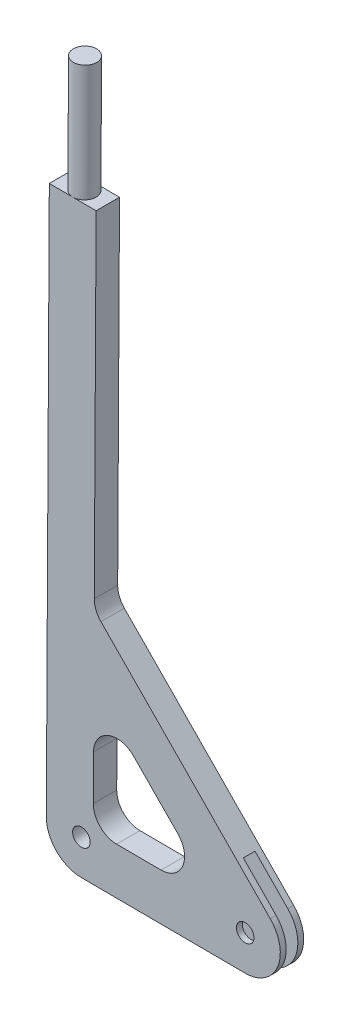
ISO-10303-21;
HEADER;
FILE_DESCRIPTION(('STEP AP214'),'2;1');
FILE_NAME('part.step','',(''),(''),'','','');
FILE_SCHEMA(('AUTOMOTIVE_DESIGN { 1 0 10303 214 1 1 1 1 }'));
ENDSEC;
DATA;
#1=APPLICATION_CONTEXT('core data for automotive mechanical design processes');
#2=APPLICATION_PROTOCOL_DEFINITION('international standard','automotive_design',2000,#1);
#3=PRODUCT_CONTEXT('',#1,'mechanical');
#4=PRODUCT('Part','Part','',(#3));
#5=PRODUCT_RELATED_PRODUCT_CATEGORY('part','',(#4));
#6=PRODUCT_DEFINITION_FORMATION('','',#4);
#7=PRODUCT_DEFINITION_CONTEXT('part definition',#1,'design');
#8=PRODUCT_DEFINITION('design','',#6,#7);
#9=PRODUCT_DEFINITION_SHAPE('','',#8);
#10=(LENGTH_UNIT() NAMED_UNIT(*) SI_UNIT(.MILLI.,.METRE.));
#11=(NAMED_UNIT(*) PLANE_ANGLE_UNIT() SI_UNIT($,.RADIAN.));
#12=(NAMED_UNIT(*) SI_UNIT($,.STERADIAN.) SOLID_ANGLE_UNIT());
#13=UNCERTAINTY_MEASURE_WITH_UNIT(LENGTH_MEASURE(1.E-05),#10,'distance_accuracy_value','');
#14=(GEOMETRIC_REPRESENTATION_CONTEXT(3) GLOBAL_UNCERTAINTY_ASSIGNED_CONTEXT((#13)) GLOBAL_UNIT_ASSIGNED_CONTEXT((#10,
#11,#12)) REPRESENTATION_CONTEXT('',''));
#15=CARTESIAN_POINT('',(0.,0.,0.));
#16=DIRECTION('',(0.,0.,1.));
#17=DIRECTION('',(1.,0.,0.));
#18=AXIS2_PLACEMENT_3D('',#15,#16,#17);
#19=CARTESIAN_POINT('',(359.062031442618,352.13946195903,12.7));
#20=DIRECTION('',(0.713955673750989,0.700190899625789,0.));
#21=DIRECTION('',(-0.700190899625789,0.713955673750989,0.));
#22=AXIS2_PLACEMENT_3D('',#19,#20,#21);
#23=PLANE('',#22);
#24=DIRECTION('',(0.,0.,1.));
#25=VECTOR('',#24,1.);
#26=CARTESIAN_POINT('',(426.491751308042,283.384168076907,-6.35));
#27=LINE('',#26,#25);
#28=CARTESIAN_POINT('',(426.491751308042,283.384168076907,-6.35));
#29=VERTEX_POINT('',#28);
#30=CARTESIAN_POINT('',(426.491751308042,283.384168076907,6.35));
#31=VERTEX_POINT('',#30);
#32=EDGE_CURVE('E203',#29,#31,#27,.T.);
#33=ORIENTED_EDGE('',*,*,#32,.F.);
#34=DIRECTION('',(0.700190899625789,-0.713955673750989,0.));
#35=VECTOR('',#34,1.);
#36=CARTESIAN_POINT('',(359.062031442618,352.13946195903,-6.35));
#37=LINE('',#36,#35);
#38=CARTESIAN_POINT('',(462.061449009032,247.115219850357,-6.35));
#39=VERTEX_POINT('',#38);
#40=EDGE_CURVE('E184',#29,#39,#37,.T.);
#41=ORIENTED_EDGE('',*,*,#40,.T.);
#42=DIRECTION('',(0.,0.,-1.));
#43=VECTOR('',#42,1.);
#44=CARTESIAN_POINT('',(462.061449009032,247.115219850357,12.7));
#45=LINE('',#44,#43);
#46=CARTESIAN_POINT('',(462.061449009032,247.115219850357,-12.7));
#47=VERTEX_POINT('',#46);
#48=EDGE_CURVE('E330',#39,#47,#45,.T.);
#49=ORIENTED_EDGE('',*,*,#48,.T.);
#50=DIRECTION('',(0.700190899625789,-0.713955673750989,0.));
#51=VECTOR('',#50,1.);
#52=CARTESIAN_POINT('',(359.062031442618,352.13946195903,-12.7));
#53=LINE('',#52,#51);
#54=CARTESIAN_POINT('',(278.285606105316,434.503838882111,-12.7));
#55=VERTEX_POINT('',#54);
#56=EDGE_CURVE('E298',#55,#47,#53,.T.);
#57=ORIENTED_EDGE('',*,*,#56,.F.);
#58=DIRECTION('',(0.,0.,-1.));
#59=VECTOR('',#58,1.);
#60=CARTESIAN_POINT('',(278.285606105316,434.503838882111,12.7));
#61=LINE('',#60,#59);
#62=CARTESIAN_POINT('',(278.285606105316,434.503838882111,12.7));
#63=VERTEX_POINT('',#62);
#64=EDGE_CURVE('E344',#63,#55,#61,.T.);
#65=ORIENTED_EDGE('',*,*,#64,.F.);
#66=DIRECTION('',(0.700190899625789,-0.713955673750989,0.));
#67=VECTOR('',#66,1.);
#68=CARTESIAN_POINT('',(359.062031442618,352.13946195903,12.7));
#69=LINE('',#68,#67);
#70=CARTESIAN_POINT('',(462.061449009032,247.115219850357,12.7));
#71=VERTEX_POINT('',#70);
#72=EDGE_CURVE('E255',#63,#71,#69,.T.);
#73=ORIENTED_EDGE('',*,*,#72,.T.);
#74=CARTESIAN_POINT('',(462.061449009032,247.115219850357,6.35));
#75=VERTEX_POINT('',#74);
#76=EDGE_CURVE('E322',#71,#75,#45,.T.);
#77=ORIENTED_EDGE('',*,*,#76,.T.);
#78=DIRECTION('',(0.700190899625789,-0.713955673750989,0.));
#79=VECTOR('',#78,1.);
#80=CARTESIAN_POINT('',(359.062031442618,352.13946195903,6.35));
#81=LINE('',#80,#79);
#82=EDGE_CURVE('E57',#31,#75,#81,.T.);
#83=ORIENTED_EDGE('',*,*,#82,.F.);
#84=EDGE_LOOP('',(#33,#41,#49,#57,#65,#73,#77,#83));
#85=FACE_BOUND('',#84,.T.);
#86=ADVANCED_FACE('F41',(#85),#23,.T.);
#87=CARTESIAN_POINT('',(1.00782110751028,184.704645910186,12.7));
#88=DIRECTION('',(0.00545631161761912,0.999985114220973,0.));
#89=DIRECTION('',(-0.999985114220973,0.00545631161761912,0.));
#90=AXIS2_PLACEMENT_3D('',#87,#88,#89);
#91=PLANE('',#90);
#92=DIRECTION('',(0.999985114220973,-0.00545631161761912,0.));
#93=VECTOR('',#92,1.);
#94=CARTESIAN_POINT('',(1.00782110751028,184.704645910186,-6.35));
#95=LINE('',#94,#93);
#96=CARTESIAN_POINT('',(383.85336475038,182.615690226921,-6.35));
#97=VERTEX_POINT('',#96);
#98=CARTESIAN_POINT('',(434.651852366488,182.338513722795,-6.35));
#99=VERTEX_POINT('',#98);
#100=EDGE_CURVE('E194',#97,#99,#95,.T.);
#101=ORIENTED_EDGE('',*,*,#100,.F.);
#102=DIRECTION('',(0.,0.,1.));
#103=VECTOR('',#102,1.);
#104=CARTESIAN_POINT('',(383.85336475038,182.615690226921,-6.35));
#105=LINE('',#104,#103);
#106=CARTESIAN_POINT('',(383.85336475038,182.615690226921,6.35));
#107=VERTEX_POINT('',#106);
#108=EDGE_CURVE('E220',#97,#107,#105,.T.);
#109=ORIENTED_EDGE('',*,*,#108,.T.);
#110=DIRECTION('',(0.999985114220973,-0.00545631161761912,0.));
#111=VECTOR('',#110,1.);
#112=CARTESIAN_POINT('',(1.00782110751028,184.704645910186,6.35));
#113=LINE('',#112,#111);
#114=CARTESIAN_POINT('',(434.651852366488,182.338513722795,6.35));
#115=VERTEX_POINT('',#114);
#116=EDGE_CURVE('E212',#107,#115,#113,.T.);
#117=ORIENTED_EDGE('',*,*,#116,.T.);
#118=DIRECTION('',(0.,0.,-1.));
#119=VECTOR('',#118,1.);
#120=CARTESIAN_POINT('',(434.651852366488,182.338513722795,12.7));
#121=LINE('',#120,#119);
#122=CARTESIAN_POINT('',(434.651852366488,182.338513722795,12.7));
#123=VERTEX_POINT('',#122);
#124=EDGE_CURVE('E327',#123,#115,#121,.T.);
#125=ORIENTED_EDGE('',*,*,#124,.F.);
#126=DIRECTION('',(0.999985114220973,-0.00545631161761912,0.));
#127=VECTOR('',#126,1.);
#128=CARTESIAN_POINT('',(1.00782110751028,184.704645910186,12.7));
#129=LINE('',#128,#127);
#130=CARTESIAN_POINT('',(256.851852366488,183.308660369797,12.7));
#131=VERTEX_POINT('',#130);
#132=EDGE_CURVE('E275',#131,#123,#129,.T.);
#133=ORIENTED_EDGE('',*,*,#132,.F.);
#134=DIRECTION('',(0.,0.,-1.));
#135=VECTOR('',#134,1.);
#136=CARTESIAN_POINT('',(256.851852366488,183.308660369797,12.7));
#137=LINE('',#136,#135);
#138=CARTESIAN_POINT('',(256.851852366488,183.308660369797,-12.7));
#139=VERTEX_POINT('',#138);
#140=EDGE_CURVE('E332',#131,#139,#137,.T.);
#141=ORIENTED_EDGE('',*,*,#140,.T.);
#142=DIRECTION('',(0.999985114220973,-0.00545631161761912,0.));
#143=VECTOR('',#142,1.);
#144=CARTESIAN_POINT('',(1.00782110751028,184.704645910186,-12.7));
#145=LINE('',#144,#143);
#146=CARTESIAN_POINT('',(434.651852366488,182.338513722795,-12.7));
#147=VERTEX_POINT('',#146);
#148=EDGE_CURVE('E317',#139,#147,#145,.T.);
#149=ORIENTED_EDGE('',*,*,#148,.T.);
#150=EDGE_CURVE('E326',#99,#147,#121,.T.);
#151=ORIENTED_EDGE('',*,*,#150,.F.);
#152=EDGE_LOOP('',(#101,#109,#117,#125,#133,#141,#149,#151));
#153=FACE_BOUND('',#152,.T.);
#154=ADVANCED_FACE('F384',(#153),#91,.F.);
#155=CARTESIAN_POINT('',(434.859737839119,220.437946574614,12.7));
#156=DIRECTION('',(0.,0.,-1.));
#157=DIRECTION('',(-1.,0.,0.));
#158=AXIS2_PLACEMENT_3D('',#155,#156,#157);
#159=CYLINDRICAL_SURFACE('',#158,9.52500000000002);
#160=CARTESIAN_POINT('',(434.859737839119,220.437946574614,-12.7));
#161=DIRECTION('',(0.,0.,1.));
#162=DIRECTION('',(1.,0.,0.));
#163=AXIS2_PLACEMENT_3D('',#160,#161,#162);
#164=CIRCLE('',#163,9.52500000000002);
#165=CARTESIAN_POINT('',(444.384737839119,220.437946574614,-12.7));
#166=VERTEX_POINT('',#165);
#167=EDGE_CURVE('E300',#166,#166,#164,.T.);
#168=ORIENTED_EDGE('',*,*,#167,.F.);
#169=EDGE_LOOP('',(#168));
#170=FACE_BOUND('',#169,.T.);
#171=CARTESIAN_POINT('',(434.859737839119,220.437946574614,-6.35));
#172=DIRECTION('',(0.,0.,1.));
#173=DIRECTION('',(1.,0.,0.));
#174=AXIS2_PLACEMENT_3D('',#171,#172,#173);
#175=CIRCLE('',#174,9.52500000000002);
#176=CARTESIAN_POINT('',(444.384737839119,220.437946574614,-6.35));
#177=VERTEX_POINT('',#176);
#178=EDGE_CURVE('E193',#177,#177,#175,.T.);
#179=ORIENTED_EDGE('',*,*,#178,.T.);
#180=EDGE_LOOP('',(#179));
#181=FACE_BOUND('',#180,.T.);
#182=ADVANCED_FACE('F432',(#170,#181),#159,.F.);
#183=CARTESIAN_POINT('',(434.859737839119,220.437946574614,12.7));
#184=DIRECTION('',(0.,0.,-1.));
#185=DIRECTION('',(-1.,0.,0.));
#186=AXIS2_PLACEMENT_3D('',#183,#184,#185);
#187=CYLINDRICAL_SURFACE('',#186,38.0999999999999);
#188=CARTESIAN_POINT('',(434.859737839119,220.437946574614,-6.35));
#189=DIRECTION('',(0.,0.,1.));
#190=DIRECTION('',(1.,0.,0.));
#191=AXIS2_PLACEMENT_3D('',#188,#189,#190);
#192=CIRCLE('',#191,38.0999999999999);
#193=EDGE_CURVE('E11',#99,#39,#192,.T.);
#194=ORIENTED_EDGE('',*,*,#193,.F.);
#195=ORIENTED_EDGE('',*,*,#150,.T.);
#196=CARTESIAN_POINT('',(434.859737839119,220.437946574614,-12.7));
#197=DIRECTION('',(0.,0.,1.));
#198=DIRECTION('',(1.,0.,0.));
#199=AXIS2_PLACEMENT_3D('',#196,#197,#198);
#200=CIRCLE('',#199,38.0999999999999);
#201=EDGE_CURVE('E237',#147,#47,#200,.T.);
#202=ORIENTED_EDGE('',*,*,#201,.T.);
#203=ORIENTED_EDGE('',*,*,#48,.F.);
#204=EDGE_LOOP('',(#194,#195,#202,#203));
#205=FACE_BOUND('',#204,.T.);
#206=ADVANCED_FACE('F396',(#205),#187,.T.);
#207=CARTESIAN_POINT('',(4.47257898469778,819.695193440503,12.7));
#208=DIRECTION('',(0.00545631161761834,0.999985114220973,0.));
#209=DIRECTION('',(-0.999985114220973,0.00545631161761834,0.));
#210=AXIS2_PLACEMENT_3D('',#207,#208,#209);
#211=PLANE('',#210);
#212=CARTESIAN_POINT('',(247.61679929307,818.368503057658,0.));
#213=DIRECTION('',(0.00545631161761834,0.999985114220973,0.));
#214=DIRECTION('',(-0.999985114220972,0.00545631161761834,0.));
#215=AXIS2_PLACEMENT_3D('',#212,#213,#214);
#216=CIRCLE('',#215,12.7);
#217=CARTESIAN_POINT('',(247.61679929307,818.368503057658,12.7));
#218=VERTEX_POINT('',#217);
#219=CARTESIAN_POINT('',(247.61679929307,818.368503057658,-12.7));
#220=VERTEX_POINT('',#219);
#221=EDGE_CURVE('E223',#218,#220,#216,.T.);
#222=ORIENTED_EDGE('',*,*,#221,.F.);
#223=DIRECTION('',(0.999985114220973,-0.00545631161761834,0.));
#224=VECTOR('',#223,1.);
#225=CARTESIAN_POINT('',(4.47257898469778,819.695193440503,12.7));
#226=LINE('',#225,#224);
#227=CARTESIAN_POINT('',(273.016421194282,818.22991274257,12.7));
#228=VERTEX_POINT('',#227);
#229=EDGE_CURVE('E263',#218,#228,#226,.T.);
#230=ORIENTED_EDGE('',*,*,#229,.T.);
#231=DIRECTION('',(0.,0.,-1.));
#232=VECTOR('',#231,1.);
#233=CARTESIAN_POINT('',(273.016421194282,818.22991274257,12.7));
#234=LINE('',#233,#232);
#235=CARTESIAN_POINT('',(273.016421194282,818.22991274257,-12.7));
#236=VERTEX_POINT('',#235);
#237=EDGE_CURVE('E339',#228,#236,#234,.T.);
#238=ORIENTED_EDGE('',*,*,#237,.T.);
#239=DIRECTION('',(0.999985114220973,-0.00545631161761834,0.));
#240=VECTOR('',#239,1.);
#241=CARTESIAN_POINT('',(4.47257898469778,819.695193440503,-12.7));
#242=LINE('',#241,#240);
#243=EDGE_CURVE('E310',#220,#236,#242,.T.);
#244=ORIENTED_EDGE('',*,*,#243,.F.);
#245=EDGE_LOOP('',(#222,#230,#238,#244));
#246=FACE_BOUND('',#245,.T.);
#247=ADVANCED_FACE('F361',(#246),#211,.T.);
#248=CARTESIAN_POINT('',(296.420080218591,452.288687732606,12.7));
#249=DIRECTION('',(0.,0.,-1.));
#250=DIRECTION('',(-1.,0.,0.));
#251=AXIS2_PLACEMENT_3D('',#248,#249,#250);
#252=CYLINDRICAL_SURFACE('',#251,25.4);
#253=CARTESIAN_POINT('',(296.420080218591,452.288687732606,-12.7));
#254=DIRECTION('',(0.,0.,1.));
#255=DIRECTION('',(1.,0.,0.));
#256=AXIS2_PLACEMENT_3D('',#253,#254,#255);
#257=CIRCLE('',#256,25.4);
#258=CARTESIAN_POINT('',(271.020458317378,452.427278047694,-12.7));
#259=VERTEX_POINT('',#258);
#260=EDGE_CURVE('E302',#55,#259,#257,.F.);
#261=ORIENTED_EDGE('',*,*,#260,.T.);
#262=DIRECTION('',(0.,0.,-1.));
#263=VECTOR('',#262,1.);
#264=CARTESIAN_POINT('',(271.020458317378,452.427278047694,12.7));
#265=LINE('',#264,#263);
#266=CARTESIAN_POINT('',(271.020458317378,452.427278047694,12.7));
#267=VERTEX_POINT('',#266);
#268=EDGE_CURVE('E343',#267,#259,#265,.T.);
#269=ORIENTED_EDGE('',*,*,#268,.F.);
#270=CARTESIAN_POINT('',(296.420080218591,452.288687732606,12.7));
#271=DIRECTION('',(0.,0.,1.));
#272=DIRECTION('',(1.,0.,0.));
#273=AXIS2_PLACEMENT_3D('',#270,#271,#272);
#274=CIRCLE('',#273,25.4);
#275=EDGE_CURVE('E260',#63,#267,#274,.F.);
#276=ORIENTED_EDGE('',*,*,#275,.F.);
#277=ORIENTED_EDGE('',*,*,#64,.T.);
#278=EDGE_LOOP('',(#261,#269,#276,#277));
#279=FACE_BOUND('',#278,.T.);
#280=ADVANCED_FACE('F395',(#279),#252,.F.);
#281=CARTESIAN_POINT('',(268.543842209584,-1.46528069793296,12.7));
#282=DIRECTION('',(-0.999985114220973,0.00545631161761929,0.));
#283=DIRECTION('',(-0.00545631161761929,-0.999985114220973,0.));
#284=AXIS2_PLACEMENT_3D('',#281,#282,#283);
#285=PLANE('',#284);
#286=DIRECTION('',(0.00545631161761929,0.999985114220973,0.));
#287=VECTOR('',#286,1.);
#288=CARTESIAN_POINT('',(268.543842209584,-1.46528069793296,-12.7));
#289=LINE('',#288,#287);
#290=EDGE_CURVE('E308',#259,#236,#289,.T.);
#291=ORIENTED_EDGE('',*,*,#290,.T.);
#292=ORIENTED_EDGE('',*,*,#237,.F.);
#293=DIRECTION('',(0.00545631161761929,0.999985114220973,0.));
#294=VECTOR('',#293,1.);
#295=CARTESIAN_POINT('',(268.543842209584,-1.46528069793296,12.7));
#296=LINE('',#295,#294);
#297=EDGE_CURVE('E257',#267,#228,#296,.T.);
#298=ORIENTED_EDGE('',*,*,#297,.F.);
#299=ORIENTED_EDGE('',*,*,#268,.T.);
#300=EDGE_LOOP('',(#291,#292,#298,#299));
#301=FACE_BOUND('',#300,.T.);
#302=ADVANCED_FACE('F393',(#301),#285,.F.);
#303=EDGE_CURVE('E61',#220,#218,#216,.T.);
#304=ORIENTED_EDGE('',*,*,#303,.F.);
#305=CARTESIAN_POINT('',(222.217177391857,818.507093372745,-12.7));
#306=VERTEX_POINT('',#305);
#307=EDGE_CURVE('E309',#306,#220,#242,.T.);
#308=ORIENTED_EDGE('',*,*,#307,.F.);
#309=DIRECTION('',(0.,0.,-1.));
#310=VECTOR('',#309,1.);
#311=CARTESIAN_POINT('',(222.217177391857,818.507093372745,12.7));
#312=LINE('',#311,#310);
#313=CARTESIAN_POINT('',(222.217177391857,818.507093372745,12.7));
#314=VERTEX_POINT('',#313);
#315=EDGE_CURVE('E337',#314,#306,#312,.T.);
#316=ORIENTED_EDGE('',*,*,#315,.F.);
#317=EDGE_CURVE('E262',#314,#218,#226,.T.);
#318=ORIENTED_EDGE('',*,*,#317,.T.);
#319=EDGE_LOOP('',(#304,#308,#316,#318));
#320=FACE_BOUND('',#319,.T.);
#321=ADVANCED_FACE('F367',(#320),#211,.T.);
#322=CARTESIAN_POINT('',(217.744598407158,-1.18810006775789,12.7));
#323=DIRECTION('',(-0.999985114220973,0.00545631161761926,0.));
#324=DIRECTION('',(-0.00545631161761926,-0.999985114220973,0.));
#325=AXIS2_PLACEMENT_3D('',#322,#323,#324);
#326=PLANE('',#325);
#327=DIRECTION('',(0.00545631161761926,0.999985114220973,0.));
#328=VECTOR('',#327,1.);
#329=CARTESIAN_POINT('',(217.744598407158,-1.18810006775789,-12.7));
#330=LINE('',#329,#328);
#331=CARTESIAN_POINT('',(218.9603049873,221.615978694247,-12.7));
#332=VERTEX_POINT('',#331);
#333=EDGE_CURVE('E311',#332,#306,#330,.T.);
#334=ORIENTED_EDGE('',*,*,#333,.F.);
#335=DIRECTION('',(0.,0.,-1.));
#336=VECTOR('',#335,1.);
#337=CARTESIAN_POINT('',(218.9603049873,221.615978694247,12.7));
#338=LINE('',#337,#336);
#339=CARTESIAN_POINT('',(218.9603049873,221.615978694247,12.7));
#340=VERTEX_POINT('',#339);
#341=EDGE_CURVE('E331',#340,#332,#338,.T.);
#342=ORIENTED_EDGE('',*,*,#341,.F.);
#343=DIRECTION('',(0.00545631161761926,0.999985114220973,0.));
#344=VECTOR('',#343,1.);
#345=CARTESIAN_POINT('',(217.744598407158,-1.18810006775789,12.7));
#346=LINE('',#345,#344);
#347=EDGE_CURVE('E266',#340,#314,#346,.T.);
#348=ORIENTED_EDGE('',*,*,#347,.T.);
#349=ORIENTED_EDGE('',*,*,#315,.T.);
#350=EDGE_LOOP('',(#334,#342,#348,#349));
#351=FACE_BOUND('',#350,.T.);
#352=ADVANCED_FACE('F380',(#351),#326,.T.);
#353=CARTESIAN_POINT('',(257.059737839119,221.408093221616,12.7));
#354=DIRECTION('',(0.,0.,-1.));
#355=DIRECTION('',(-1.,0.,0.));
#356=AXIS2_PLACEMENT_3D('',#353,#354,#355);
#357=CYLINDRICAL_SURFACE('',#356,38.1);
#358=CARTESIAN_POINT('',(257.059737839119,221.408093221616,-12.7));
#359=DIRECTION('',(0.,0.,1.));
#360=DIRECTION('',(1.,0.,0.));
#361=AXIS2_PLACEMENT_3D('',#358,#359,#360);
#362=CIRCLE('',#361,38.1);
#363=EDGE_CURVE('E316',#332,#139,#362,.T.);
#364=ORIENTED_EDGE('',*,*,#363,.T.);
#365=ORIENTED_EDGE('',*,*,#140,.F.);
#366=CARTESIAN_POINT('',(257.059737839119,221.408093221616,12.7));
#367=DIRECTION('',(0.,0.,1.));
#368=DIRECTION('',(1.,0.,0.));
#369=AXIS2_PLACEMENT_3D('',#366,#367,#368);
#370=CIRCLE('',#369,38.1);
#371=EDGE_CURVE('E267',#340,#131,#370,.T.);
#372=ORIENTED_EDGE('',*,*,#371,.F.);
#373=ORIENTED_EDGE('',*,*,#341,.T.);
#374=EDGE_LOOP('',(#364,#365,#372,#373));
#375=FACE_BOUND('',#374,.T.);
#376=ADVANCED_FACE('F381',(#375),#357,.T.);
#377=CARTESIAN_POINT('',(295.632720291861,307.988240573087,12.7));
#378=DIRECTION('',(0.,0.,-1.));
#379=DIRECTION('',(-1.,0.,0.));
#380=AXIS2_PLACEMENT_3D('',#377,#378,#379);
#381=CYLINDRICAL_SURFACE('',#380,25.4);
#382=CARTESIAN_POINT('',(295.632720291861,307.988240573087,-12.7));
#383=DIRECTION('',(0.,0.,1.));
#384=DIRECTION('',(1.,0.,0.));
#385=AXIS2_PLACEMENT_3D('',#382,#383,#384);
#386=CIRCLE('',#385,25.4);
#387=CARTESIAN_POINT('',(313.767194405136,325.773089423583,-12.7));
#388=VERTEX_POINT('',#387);
#389=CARTESIAN_POINT('',(270.233098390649,308.126830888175,-12.7));
#390=VERTEX_POINT('',#389);
#391=EDGE_CURVE('E226',#388,#390,#386,.T.);
#392=ORIENTED_EDGE('',*,*,#391,.F.);
#393=DIRECTION('',(0.,0.,-1.));
#394=VECTOR('',#393,1.);
#395=CARTESIAN_POINT('',(313.767194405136,325.773089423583,12.7));
#396=LINE('',#395,#394);
#397=CARTESIAN_POINT('',(313.767194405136,325.773089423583,12.7));
#398=VERTEX_POINT('',#397);
#399=EDGE_CURVE('E356',#398,#388,#396,.T.);
#400=ORIENTED_EDGE('',*,*,#399,.F.);
#401=CARTESIAN_POINT('',(295.632720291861,307.988240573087,12.7));
#402=DIRECTION('',(0.,0.,1.));
#403=DIRECTION('',(1.,0.,0.));
#404=AXIS2_PLACEMENT_3D('',#401,#402,#403);
#405=CIRCLE('',#404,25.4);
#406=CARTESIAN_POINT('',(270.233098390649,308.126830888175,12.7));
#407=VERTEX_POINT('',#406);
#408=EDGE_CURVE('E235',#398,#407,#405,.T.);
#409=ORIENTED_EDGE('',*,*,#408,.T.);
#410=DIRECTION('',(0.,0.,-1.));
#411=VECTOR('',#410,1.);
#412=CARTESIAN_POINT('',(270.233098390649,308.126830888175,12.7));
#413=LINE('',#412,#411);
#414=EDGE_CURVE('E280',#407,#390,#413,.T.);
#415=ORIENTED_EDGE('',*,*,#414,.T.);
#416=EDGE_LOOP('',(#392,#400,#409,#415));
#417=FACE_BOUND('',#416,.T.);
#418=ADVANCED_FACE('F43',(#417),#381,.F.);
#419=CARTESIAN_POINT('',(322.793083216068,316.569764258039,12.7));
#420=DIRECTION('',(0.71395567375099,0.700190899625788,0.));
#421=DIRECTION('',(-0.700190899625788,0.71395567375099,0.));
#422=AXIS2_PLACEMENT_3D('',#419,#420,#421);
#423=PLANE('',#422);
#424=DIRECTION('',(0.700190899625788,-0.71395567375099,0.));
#425=VECTOR('',#424,1.);
#426=CARTESIAN_POINT('',(322.793083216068,316.569764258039,-12.7));
#427=LINE('',#426,#425);
#428=CARTESIAN_POINT('',(361.775421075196,276.821088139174,-12.7));
#429=VERTEX_POINT('',#428);
#430=EDGE_CURVE('E278',#388,#429,#427,.T.);
#431=ORIENTED_EDGE('',*,*,#430,.T.);
#432=DIRECTION('',(0.,0.,-1.));
#433=VECTOR('',#432,1.);
#434=CARTESIAN_POINT('',(361.775421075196,276.821088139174,12.7));
#435=LINE('',#434,#433);
#436=CARTESIAN_POINT('',(361.775421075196,276.821088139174,12.7));
#437=VERTEX_POINT('',#436);
#438=EDGE_CURVE('E354',#437,#429,#435,.T.);
#439=ORIENTED_EDGE('',*,*,#438,.F.);
#440=DIRECTION('',(0.700190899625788,-0.71395567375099,0.));
#441=VECTOR('',#440,1.);
#442=CARTESIAN_POINT('',(322.793083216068,316.569764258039,12.7));
#443=LINE('',#442,#441);
#444=EDGE_CURVE('E232',#398,#437,#443,.T.);
#445=ORIENTED_EDGE('',*,*,#444,.F.);
#446=ORIENTED_EDGE('',*,*,#399,.T.);
#447=EDGE_LOOP('',(#431,#439,#445,#446));
#448=FACE_BOUND('',#447,.T.);
#449=ADVANCED_FACE('F462',(#448),#423,.F.);
#450=CARTESIAN_POINT('',(343.640946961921,259.036239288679,12.7));
#451=DIRECTION('',(0.,0.,-1.));
#452=DIRECTION('',(-1.,0.,0.));
#453=AXIS2_PLACEMENT_3D('',#450,#451,#452);
#454=CYLINDRICAL_SURFACE('',#453,25.4);
#455=CARTESIAN_POINT('',(343.640946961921,259.036239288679,-12.7));
#456=DIRECTION('',(0.,0.,1.));
#457=DIRECTION('',(1.,0.,0.));
#458=AXIS2_PLACEMENT_3D('',#455,#456,#457);
#459=CIRCLE('',#458,25.4);
#460=CARTESIAN_POINT('',(343.502356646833,233.636617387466,-12.7));
#461=VERTEX_POINT('',#460);
#462=EDGE_CURVE('E285',#429,#461,#459,.F.);
#463=ORIENTED_EDGE('',*,*,#462,.T.);
#464=DIRECTION('',(0.,0.,-1.));
#465=VECTOR('',#464,1.);
#466=CARTESIAN_POINT('',(343.502356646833,233.636617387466,12.7));
#467=LINE('',#466,#465);
#468=CARTESIAN_POINT('',(343.502356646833,233.636617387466,12.7));
#469=VERTEX_POINT('',#468);
#470=EDGE_CURVE('E352',#469,#461,#467,.T.);
#471=ORIENTED_EDGE('',*,*,#470,.F.);
#472=CARTESIAN_POINT('',(343.640946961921,259.036239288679,12.7));
#473=DIRECTION('',(0.,0.,1.));
#474=DIRECTION('',(1.,0.,0.));
#475=AXIS2_PLACEMENT_3D('',#472,#473,#474);
#476=CIRCLE('',#475,25.4);
#477=EDGE_CURVE('E236',#437,#469,#476,.F.);
#478=ORIENTED_EDGE('',*,*,#477,.F.);
#479=ORIENTED_EDGE('',*,*,#438,.T.);
#480=EDGE_LOOP('',(#463,#471,#478,#479));
#481=FACE_BOUND('',#480,.T.);
#482=ADVANCED_FACE('F456',(#481),#454,.F.);
#483=CARTESIAN_POINT('',(1.28500173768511,235.503889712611,12.7));
#484=DIRECTION('',(0.00545631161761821,0.999985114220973,0.));
#485=DIRECTION('',(-0.999985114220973,0.00545631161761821,0.));
#486=AXIS2_PLACEMENT_3D('',#483,#484,#485);
#487=PLANE('',#486);
#488=DIRECTION('',(0.999985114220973,-0.00545631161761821,0.));
#489=VECTOR('',#488,1.);
#490=CARTESIAN_POINT('',(1.28500173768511,235.503889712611,-12.7));
#491=LINE('',#490,#489);
#492=CARTESIAN_POINT('',(295.228465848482,233.900018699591,-12.7));
#493=VERTEX_POINT('',#492);
#494=EDGE_CURVE('E283',#493,#461,#491,.T.);
#495=ORIENTED_EDGE('',*,*,#494,.F.);
#496=DIRECTION('',(0.,0.,-1.));
#497=VECTOR('',#496,1.);
#498=CARTESIAN_POINT('',(295.228465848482,233.900018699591,12.7));
#499=LINE('',#498,#497);
#500=CARTESIAN_POINT('',(295.228465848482,233.900018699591,12.7));
#501=VERTEX_POINT('',#500);
#502=EDGE_CURVE('E349',#501,#493,#499,.T.);
#503=ORIENTED_EDGE('',*,*,#502,.F.);
#504=DIRECTION('',(0.999985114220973,-0.00545631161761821,0.));
#505=VECTOR('',#504,1.);
#506=CARTESIAN_POINT('',(1.28500173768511,235.503889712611,12.7));
#507=LINE('',#506,#505);
#508=EDGE_CURVE('E238',#501,#469,#507,.T.);
#509=ORIENTED_EDGE('',*,*,#508,.T.);
#510=ORIENTED_EDGE('',*,*,#470,.T.);
#511=EDGE_LOOP('',(#495,#503,#509,#510));
#512=FACE_BOUND('',#511,.T.);
#513=ADVANCED_FACE('F454',(#512),#487,.T.);
#514=CARTESIAN_POINT('',(295.367056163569,259.299640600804,12.7));
#515=DIRECTION('',(0.,0.,-1.));
#516=DIRECTION('',(-1.,0.,0.));
#517=AXIS2_PLACEMENT_3D('',#514,#515,#516);
#518=CYLINDRICAL_SURFACE('',#517,25.4);
#519=CARTESIAN_POINT('',(295.367056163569,259.299640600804,-12.7));
#520=DIRECTION('',(0.,0.,1.));
#521=DIRECTION('',(1.,0.,0.));
#522=AXIS2_PLACEMENT_3D('',#519,#520,#521);
#523=CIRCLE('',#522,25.4);
#524=CARTESIAN_POINT('',(269.967434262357,259.438230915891,-12.7));
#525=VERTEX_POINT('',#524);
#526=EDGE_CURVE('E286',#525,#493,#523,.T.);
#527=ORIENTED_EDGE('',*,*,#526,.F.);
#528=DIRECTION('',(0.,0.,-1.));
#529=VECTOR('',#528,1.);
#530=CARTESIAN_POINT('',(269.967434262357,259.438230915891,12.7));
#531=LINE('',#530,#529);
#532=CARTESIAN_POINT('',(269.967434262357,259.438230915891,12.7));
#533=VERTEX_POINT('',#532);
#534=EDGE_CURVE('E350',#533,#525,#531,.T.);
#535=ORIENTED_EDGE('',*,*,#534,.F.);
#536=CARTESIAN_POINT('',(295.367056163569,259.299640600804,12.7));
#537=DIRECTION('',(0.,0.,1.));
#538=DIRECTION('',(1.,0.,0.));
#539=AXIS2_PLACEMENT_3D('',#536,#537,#538);
#540=CIRCLE('',#539,25.4);
#541=EDGE_CURVE('E244',#533,#501,#540,.T.);
#542=ORIENTED_EDGE('',*,*,#541,.T.);
#543=ORIENTED_EDGE('',*,*,#502,.T.);
#544=EDGE_LOOP('',(#527,#535,#542,#543));
#545=FACE_BOUND('',#544,.T.);
#546=ADVANCED_FACE('F444',(#545),#518,.F.);
#547=CARTESIAN_POINT('',(434.859737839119,220.437946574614,6.35));
#548=DIRECTION('',(0.,0.,1.));
#549=DIRECTION('',(1.,0.,0.));
#550=AXIS2_PLACEMENT_3D('',#547,#548,#549);
#551=CIRCLE('',#550,9.52500000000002);
#552=CARTESIAN_POINT('',(444.384737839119,220.437946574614,6.35));
#553=VERTEX_POINT('',#552);
#554=EDGE_CURVE('E218',#553,#553,#551,.T.);
#555=ORIENTED_EDGE('',*,*,#554,.F.);
#556=EDGE_LOOP('',(#555));
#557=FACE_BOUND('',#556,.T.);
#558=CARTESIAN_POINT('',(434.859737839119,220.437946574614,12.7));
#559=DIRECTION('',(0.,0.,1.));
#560=DIRECTION('',(1.,0.,0.));
#561=AXIS2_PLACEMENT_3D('',#558,#559,#560);
#562=CIRCLE('',#561,9.52500000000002);
#563=CARTESIAN_POINT('',(444.384737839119,220.437946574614,12.7));
#564=VERTEX_POINT('',#563);
#565=EDGE_CURVE('E253',#564,#564,#562,.T.);
#566=ORIENTED_EDGE('',*,*,#565,.T.);
#567=EDGE_LOOP('',(#566));
#568=FACE_BOUND('',#567,.T.);
#569=ADVANCED_FACE('F438',(#557,#568),#159,.F.);
#570=CARTESIAN_POINT('',(257.059737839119,221.408093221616,12.7));
#571=DIRECTION('',(0.,0.,-1.));
#572=DIRECTION('',(-1.,0.,0.));
#573=AXIS2_PLACEMENT_3D('',#570,#571,#572);
#574=CYLINDRICAL_SURFACE('',#573,9.52500000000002);
#575=CARTESIAN_POINT('',(257.059737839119,221.408093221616,12.7));
#576=DIRECTION('',(0.,0.,1.));
#577=DIRECTION('',(1.,0.,0.));
#578=AXIS2_PLACEMENT_3D('',#575,#576,#577);
#579=CIRCLE('',#578,9.52500000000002);
#580=CARTESIAN_POINT('',(266.584737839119,221.408093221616,12.7));
#581=VERTEX_POINT('',#580);
#582=EDGE_CURVE('E247',#581,#581,#579,.T.);
#583=ORIENTED_EDGE('',*,*,#582,.T.);
#584=EDGE_LOOP('',(#583));
#585=FACE_BOUND('',#584,.T.);
#586=CARTESIAN_POINT('',(257.059737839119,221.408093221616,-12.7));
#587=DIRECTION('',(0.,0.,1.));
#588=DIRECTION('',(1.,0.,0.));
#589=AXIS2_PLACEMENT_3D('',#586,#587,#588);
#590=CIRCLE('',#589,9.52500000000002);
#591=CARTESIAN_POINT('',(266.584737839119,221.408093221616,-12.7));
#592=VERTEX_POINT('',#591);
#593=EDGE_CURVE('E294',#592,#592,#590,.T.);
#594=ORIENTED_EDGE('',*,*,#593,.F.);
#595=EDGE_LOOP('',(#594));
#596=FACE_BOUND('',#595,.T.);
#597=ADVANCED_FACE('F445',(#585,#596),#574,.F.);
#598=CARTESIAN_POINT('',(268.543842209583,-1.46528069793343,12.7));
#599=DIRECTION('',(-0.999985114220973,0.00545631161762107,0.));
#600=DIRECTION('',(-0.00545631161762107,-0.999985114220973,0.));
#601=AXIS2_PLACEMENT_3D('',#598,#599,#600);
#602=PLANE('',#601);
#603=DIRECTION('',(0.00545631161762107,0.999985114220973,0.));
#604=VECTOR('',#603,1.);
#605=CARTESIAN_POINT('',(268.543842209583,-1.46528069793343,-12.7));
#606=LINE('',#605,#604);
#607=EDGE_CURVE('E292',#525,#390,#606,.T.);
#608=ORIENTED_EDGE('',*,*,#607,.T.);
#609=ORIENTED_EDGE('',*,*,#414,.F.);
#610=DIRECTION('',(0.00545631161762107,0.999985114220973,0.));
#611=VECTOR('',#610,1.);
#612=CARTESIAN_POINT('',(268.543842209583,-1.46528069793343,12.7));
#613=LINE('',#612,#611);
#614=EDGE_CURVE('E246',#533,#407,#613,.T.);
#615=ORIENTED_EDGE('',*,*,#614,.F.);
#616=ORIENTED_EDGE('',*,*,#534,.T.);
#617=EDGE_LOOP('',(#608,#609,#615,#616));
#618=FACE_BOUND('',#617,.T.);
#619=ADVANCED_FACE('F450',(#618),#602,.F.);
#620=ORIENTED_EDGE('',*,*,#124,.T.);
#621=CARTESIAN_POINT('',(434.859737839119,220.437946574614,6.35));
#622=DIRECTION('',(0.,0.,1.));
#623=DIRECTION('',(1.,0.,0.));
#624=AXIS2_PLACEMENT_3D('',#621,#622,#623);
#625=CIRCLE('',#624,38.0999999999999);
#626=EDGE_CURVE('E47',#115,#75,#625,.T.);
#627=ORIENTED_EDGE('',*,*,#626,.T.);
#628=ORIENTED_EDGE('',*,*,#76,.F.);
#629=CARTESIAN_POINT('',(434.859737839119,220.437946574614,12.7));
#630=DIRECTION('',(0.,0.,1.));
#631=DIRECTION('',(1.,0.,0.));
#632=AXIS2_PLACEMENT_3D('',#629,#630,#631);
#633=CIRCLE('',#632,38.0999999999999);
#634=EDGE_CURVE('E274',#123,#71,#633,.T.);
#635=ORIENTED_EDGE('',*,*,#634,.F.);
#636=EDGE_LOOP('',(#620,#627,#628,#635));
#637=FACE_BOUND('',#636,.T.);
#638=ADVANCED_FACE('F390',(#637),#187,.T.);
#639=CARTESIAN_POINT('',(0.,0.,12.7));
#640=DIRECTION('',(0.,0.,1.));
#641=DIRECTION('',(1.,0.,0.));
#642=AXIS2_PLACEMENT_3D('',#639,#640,#641);
#643=PLANE('',#642);
#644=ORIENTED_EDGE('',*,*,#408,.F.);
#645=ORIENTED_EDGE('',*,*,#444,.T.);
#646=ORIENTED_EDGE('',*,*,#477,.T.);
#647=ORIENTED_EDGE('',*,*,#508,.F.);
#648=ORIENTED_EDGE('',*,*,#541,.F.);
#649=ORIENTED_EDGE('',*,*,#614,.T.);
#650=EDGE_LOOP('',(#644,#645,#646,#647,#648,#649));
#651=FACE_BOUND('',#650,.T.);
#652=ORIENTED_EDGE('',*,*,#582,.F.);
#653=EDGE_LOOP('',(#652));
#654=FACE_BOUND('',#653,.T.);
#655=ORIENTED_EDGE('',*,*,#565,.F.);
#656=EDGE_LOOP('',(#655));
#657=FACE_BOUND('',#656,.T.);
#658=ORIENTED_EDGE('',*,*,#72,.F.);
#659=ORIENTED_EDGE('',*,*,#275,.T.);
#660=ORIENTED_EDGE('',*,*,#297,.T.);
#661=ORIENTED_EDGE('',*,*,#229,.F.);
#662=ORIENTED_EDGE('',*,*,#317,.F.);
#663=ORIENTED_EDGE('',*,*,#347,.F.);
#664=ORIENTED_EDGE('',*,*,#371,.T.);
#665=ORIENTED_EDGE('',*,*,#132,.T.);
#666=ORIENTED_EDGE('',*,*,#634,.T.);
#667=EDGE_LOOP('',(#658,#659,#660,#661,#662,#663,#664,#665,#666));
#668=FACE_BOUND('',#667,.T.);
#669=ADVANCED_FACE('F376',(#651,#654,#657,#668),#643,.T.);
#670=CARTESIAN_POINT('',(0.,0.,-12.7));
#671=DIRECTION('',(0.,0.,1.));
#672=DIRECTION('',(1.,0.,0.));
#673=AXIS2_PLACEMENT_3D('',#670,#671,#672);
#674=PLANE('',#673);
#675=ORIENTED_EDGE('',*,*,#391,.T.);
#676=ORIENTED_EDGE('',*,*,#607,.F.);
#677=ORIENTED_EDGE('',*,*,#526,.T.);
#678=ORIENTED_EDGE('',*,*,#494,.T.);
#679=ORIENTED_EDGE('',*,*,#462,.F.);
#680=ORIENTED_EDGE('',*,*,#430,.F.);
#681=EDGE_LOOP('',(#675,#676,#677,#678,#679,#680));
#682=FACE_BOUND('',#681,.T.);
#683=ORIENTED_EDGE('',*,*,#593,.T.);
#684=EDGE_LOOP('',(#683));
#685=FACE_BOUND('',#684,.T.);
#686=ORIENTED_EDGE('',*,*,#167,.T.);
#687=EDGE_LOOP('',(#686));
#688=FACE_BOUND('',#687,.T.);
#689=ORIENTED_EDGE('',*,*,#56,.T.);
#690=ORIENTED_EDGE('',*,*,#201,.F.);
#691=ORIENTED_EDGE('',*,*,#148,.F.);
#692=ORIENTED_EDGE('',*,*,#363,.F.);
#693=ORIENTED_EDGE('',*,*,#333,.T.);
#694=ORIENTED_EDGE('',*,*,#307,.T.);
#695=ORIENTED_EDGE('',*,*,#243,.T.);
#696=ORIENTED_EDGE('',*,*,#290,.F.);
#697=ORIENTED_EDGE('',*,*,#260,.F.);
#698=EDGE_LOOP('',(#689,#690,#691,#692,#693,#694,#695,#696,#697));
#699=FACE_BOUND('',#698,.T.);
#700=ADVANCED_FACE('F370',(#682,#685,#688,#699),#674,.F.);
#701=CARTESIAN_POINT('',(248.309750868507,945.366612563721,0.));
#702=DIRECTION('',(-0.00545631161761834,-0.999985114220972,0.));
#703=DIRECTION('',(0.999985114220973,-0.00545631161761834,0.));
#704=AXIS2_PLACEMENT_3D('',#701,#702,#703);
#705=CYLINDRICAL_SURFACE('',#704,12.7);
#706=CARTESIAN_POINT('',(248.309750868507,945.366612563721,0.));
#707=DIRECTION('',(0.00545631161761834,0.999985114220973,0.));
#708=DIRECTION('',(-0.999985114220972,0.00545631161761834,0.));
#709=AXIS2_PLACEMENT_3D('',#706,#707,#708);
#710=CIRCLE('',#709,12.7);
#711=CARTESIAN_POINT('',(235.609939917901,945.435907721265,0.));
#712=VERTEX_POINT('',#711);
#713=EDGE_CURVE('E227',#712,#712,#710,.T.);
#714=ORIENTED_EDGE('',*,*,#713,.F.);
#715=EDGE_LOOP('',(#714));
#716=FACE_BOUND('',#715,.T.);
#717=ORIENTED_EDGE('',*,*,#221,.T.);
#718=ORIENTED_EDGE('',*,*,#303,.T.);
#719=EDGE_LOOP('',(#717,#718));
#720=FACE_BOUND('',#719,.T.);
#721=ADVANCED_FACE('F359',(#716,#720),#705,.T.);
#722=CARTESIAN_POINT('',(248.309750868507,945.366612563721,0.));
#723=DIRECTION('',(0.00545631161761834,0.999985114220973,0.));
#724=DIRECTION('',(-0.999985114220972,0.00545631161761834,0.));
#725=AXIS2_PLACEMENT_3D('',#722,#723,#724);
#726=PLANE('',#725);
#727=ORIENTED_EDGE('',*,*,#713,.T.);
#728=EDGE_LOOP('',(#727));
#729=FACE_BOUND('',#728,.T.);
#730=ADVANCED_FACE('F536',(#729),#726,.T.);
#731=CARTESIAN_POINT('',(382.84554364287,-2.0889556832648,-6.35));
#732=DIRECTION('',(0.999985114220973,-0.00545631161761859,0.));
#733=DIRECTION('',(0.00545631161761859,0.999985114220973,0.));
#734=AXIS2_PLACEMENT_3D('',#731,#732,#733);
#735=PLANE('',#734);
#736=DIRECTION('',(0.00545631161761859,0.999985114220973,0.));
#737=VECTOR('',#736,1.);
#738=CARTESIAN_POINT('',(382.84554364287,-2.0889556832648,6.35));
#739=LINE('',#738,#737);
#740=CARTESIAN_POINT('',(384.059737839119,220.437946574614,6.35));
#741=VERTEX_POINT('',#740);
#742=EDGE_CURVE('E204',#107,#741,#739,.T.);
#743=ORIENTED_EDGE('',*,*,#742,.F.);
#744=ORIENTED_EDGE('',*,*,#108,.F.);
#745=DIRECTION('',(0.00545631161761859,0.999985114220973,0.));
#746=VECTOR('',#745,1.);
#747=CARTESIAN_POINT('',(382.84554364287,-2.0889556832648,-6.35));
#748=LINE('',#747,#746);
#749=CARTESIAN_POINT('',(384.059737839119,220.437946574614,-6.35));
#750=VERTEX_POINT('',#749);
#751=EDGE_CURVE('E210',#97,#750,#748,.T.);
#752=ORIENTED_EDGE('',*,*,#751,.T.);
#753=DIRECTION('',(0.,0.,1.));
#754=VECTOR('',#753,1.);
#755=CARTESIAN_POINT('',(384.059737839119,220.437946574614,-6.35));
#756=LINE('',#755,#754);
#757=EDGE_CURVE('E207',#750,#741,#756,.T.);
#758=ORIENTED_EDGE('',*,*,#757,.T.);
#759=EDGE_LOOP('',(#743,#744,#752,#758));
#760=FACE_BOUND('',#759,.T.);
#761=ADVANCED_FACE('F404',(#760),#735,.T.);
#762=CARTESIAN_POINT('',(434.859737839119,220.437946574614,-6.35));
#763=DIRECTION('',(0.,0.,1.));
#764=DIRECTION('',(1.,0.,0.));
#765=AXIS2_PLACEMENT_3D('',#762,#763,#764);
#766=CYLINDRICAL_SURFACE('',#765,50.8);
#767=CARTESIAN_POINT('',(434.859737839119,220.437946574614,6.35));
#768=DIRECTION('',(0.,0.,1.));
#769=DIRECTION('',(1.,0.,0.));
#770=AXIS2_PLACEMENT_3D('',#767,#768,#769);
#771=CIRCLE('',#770,50.8);
#772=CARTESIAN_POINT('',(399.290040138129,256.706894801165,6.35));
#773=VERTEX_POINT('',#772);
#774=EDGE_CURVE('E408',#773,#741,#771,.T.);
#775=ORIENTED_EDGE('',*,*,#774,.T.);
#776=ORIENTED_EDGE('',*,*,#757,.F.);
#777=CARTESIAN_POINT('',(434.859737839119,220.437946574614,-6.35));
#778=DIRECTION('',(0.,0.,1.));
#779=DIRECTION('',(1.,0.,0.));
#780=AXIS2_PLACEMENT_3D('',#777,#778,#779);
#781=CIRCLE('',#780,50.8);
#782=CARTESIAN_POINT('',(399.290040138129,256.706894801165,-6.35));
#783=VERTEX_POINT('',#782);
#784=EDGE_CURVE('E201',#783,#750,#781,.T.);
#785=ORIENTED_EDGE('',*,*,#784,.F.);
#786=DIRECTION('',(0.,0.,1.));
#787=VECTOR('',#786,1.);
#788=CARTESIAN_POINT('',(399.290040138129,256.706894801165,-6.35));
#789=LINE('',#788,#787);
#790=EDGE_CURVE('E205',#783,#773,#789,.T.);
#791=ORIENTED_EDGE('',*,*,#790,.T.);
#792=EDGE_LOOP('',(#775,#776,#785,#791));
#793=FACE_BOUND('',#792,.T.);
#794=ADVANCED_FACE('F409',(#793),#766,.F.);
#795=CARTESIAN_POINT('',(67.429719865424,-68.755293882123,-6.35));
#796=DIRECTION('',(0.70019089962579,-0.713955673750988,0.));
#797=DIRECTION('',(0.713955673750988,0.70019089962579,0.));
#798=AXIS2_PLACEMENT_3D('',#795,#796,#797);
#799=PLANE('',#798);
#800=DIRECTION('',(0.713955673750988,0.70019089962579,0.));
#801=VECTOR('',#800,1.);
#802=CARTESIAN_POINT('',(67.429719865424,-68.755293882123,6.35));
#803=LINE('',#802,#801);
#804=EDGE_CURVE('E414',#773,#31,#803,.T.);
#805=ORIENTED_EDGE('',*,*,#804,.F.);
#806=ORIENTED_EDGE('',*,*,#790,.F.);
#807=DIRECTION('',(0.713955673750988,0.70019089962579,0.));
#808=VECTOR('',#807,1.);
#809=CARTESIAN_POINT('',(67.429719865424,-68.755293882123,-6.35));
#810=LINE('',#809,#808);
#811=EDGE_CURVE('E189',#783,#29,#810,.T.);
#812=ORIENTED_EDGE('',*,*,#811,.T.);
#813=ORIENTED_EDGE('',*,*,#32,.T.);
#814=EDGE_LOOP('',(#805,#806,#812,#813));
#815=FACE_BOUND('',#814,.T.);
#816=ADVANCED_FACE('F199',(#815),#799,.T.);
#817=CARTESIAN_POINT('',(0.,0.,-6.35));
#818=DIRECTION('',(0.,0.,1.));
#819=DIRECTION('',(1.,0.,0.));
#820=AXIS2_PLACEMENT_3D('',#817,#818,#819);
#821=PLANE('',#820);
#822=ORIENTED_EDGE('',*,*,#178,.F.);
#823=EDGE_LOOP('',(#822));
#824=FACE_BOUND('',#823,.T.);
#825=ORIENTED_EDGE('',*,*,#811,.F.);
#826=ORIENTED_EDGE('',*,*,#784,.T.);
#827=ORIENTED_EDGE('',*,*,#751,.F.);
#828=ORIENTED_EDGE('',*,*,#100,.T.);
#829=ORIENTED_EDGE('',*,*,#193,.T.);
#830=ORIENTED_EDGE('',*,*,#40,.F.);
#831=EDGE_LOOP('',(#825,#826,#827,#828,#829,#830));
#832=FACE_BOUND('',#831,.T.);
#833=ADVANCED_FACE('F187',(#824,#832),#821,.T.);
#834=CARTESIAN_POINT('',(0.,0.,6.35));
#835=DIRECTION('',(0.,0.,1.));
#836=DIRECTION('',(1.,0.,0.));
#837=AXIS2_PLACEMENT_3D('',#834,#835,#836);
#838=PLANE('',#837);
#839=ORIENTED_EDGE('',*,*,#554,.T.);
#840=EDGE_LOOP('',(#839));
#841=FACE_BOUND('',#840,.T.);
#842=ORIENTED_EDGE('',*,*,#82,.T.);
#843=ORIENTED_EDGE('',*,*,#626,.F.);
#844=ORIENTED_EDGE('',*,*,#116,.F.);
#845=ORIENTED_EDGE('',*,*,#742,.T.);
#846=ORIENTED_EDGE('',*,*,#774,.F.);
#847=ORIENTED_EDGE('',*,*,#804,.T.);
#848=EDGE_LOOP('',(#842,#843,#844,#845,#846,#847));
#849=FACE_BOUND('',#848,.T.);
#850=ADVANCED_FACE('F417',(#841,#849),#838,.F.);
#851=CLOSED_SHELL('',(#86,#154,#182,#206,#247,#280,#302,#321,#352,#376,#418,#449,#482,#513,#546,
#569,#597,#619,#638,#669,#700,#721,#730,#761,#794,#816,#833,#850));
#852=MANIFOLD_SOLID_BREP('B2',#851);
#853=ADVANCED_BREP_SHAPE_REPRESENTATION('',(#18,#852),#14);
#854=SHAPE_DEFINITION_REPRESENTATION(#9,#853);
ENDSEC;
END-ISO-10303-21;
